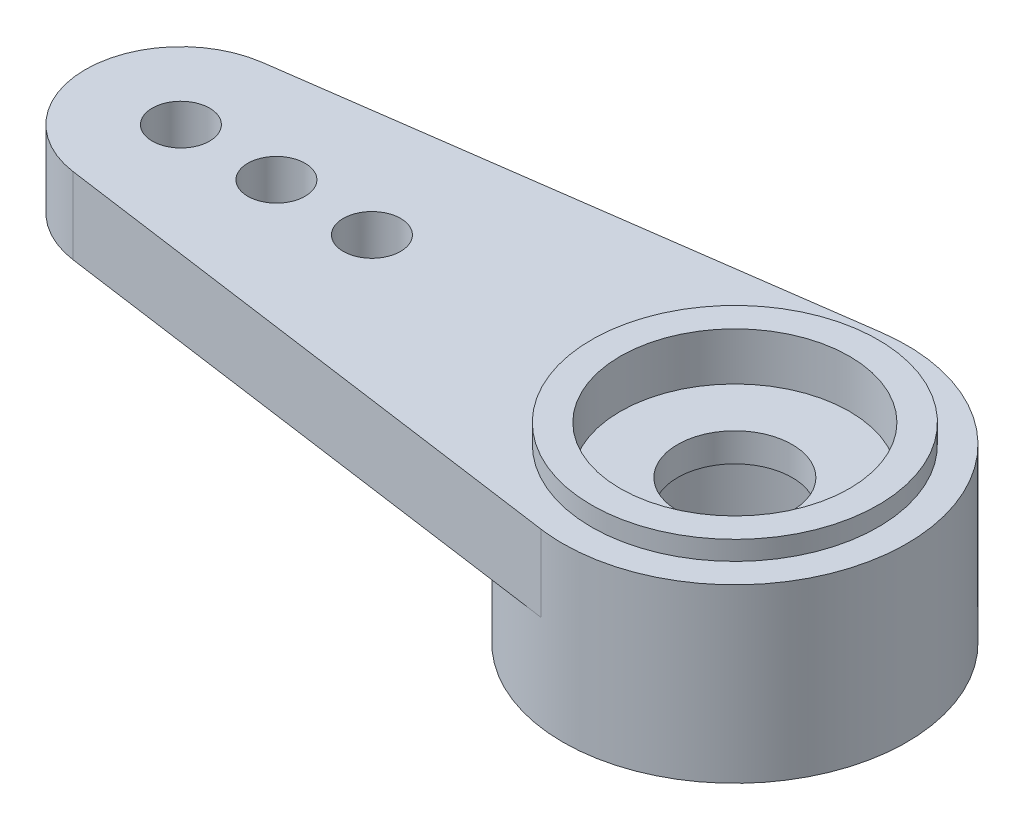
ISO-10303-21;
HEADER;
FILE_DESCRIPTION(('STEP AP214'),'2;1');
FILE_NAME('part.step','',(''),(''),'','','');
FILE_SCHEMA(('AUTOMOTIVE_DESIGN { 1 0 10303 214 1 1 1 1 }'));
ENDSEC;
DATA;
#1=APPLICATION_CONTEXT('core data for automotive mechanical design processes');
#2=APPLICATION_PROTOCOL_DEFINITION('international standard','automotive_design',2000,#1);
#3=PRODUCT_CONTEXT('',#1,'mechanical');
#4=PRODUCT('Part','Part','',(#3));
#5=PRODUCT_RELATED_PRODUCT_CATEGORY('part','',(#4));
#6=PRODUCT_DEFINITION_FORMATION('','',#4);
#7=PRODUCT_DEFINITION_CONTEXT('part definition',#1,'design');
#8=PRODUCT_DEFINITION('design','',#6,#7);
#9=PRODUCT_DEFINITION_SHAPE('','',#8);
#10=(LENGTH_UNIT() NAMED_UNIT(*) SI_UNIT(.MILLI.,.METRE.));
#11=(NAMED_UNIT(*) PLANE_ANGLE_UNIT() SI_UNIT($,.RADIAN.));
#12=(NAMED_UNIT(*) SI_UNIT($,.STERADIAN.) SOLID_ANGLE_UNIT());
#13=UNCERTAINTY_MEASURE_WITH_UNIT(LENGTH_MEASURE(1.E-05),#10,'distance_accuracy_value','');
#14=(GEOMETRIC_REPRESENTATION_CONTEXT(3) GLOBAL_UNCERTAINTY_ASSIGNED_CONTEXT((#13)) GLOBAL_UNIT_ASSIGNED_CONTEXT((#10,
#11,#12)) REPRESENTATION_CONTEXT('',''));
#15=CARTESIAN_POINT('',(0.,0.,0.));
#16=DIRECTION('',(0.,0.,1.));
#17=DIRECTION('',(1.,0.,0.));
#18=AXIS2_PLACEMENT_3D('',#15,#16,#17);
#19=CARTESIAN_POINT('',(17.,4.5,0.));
#20=DIRECTION('',(0.,-1.,0.));
#21=DIRECTION('',(0.,0.,-1.));
#22=AXIS2_PLACEMENT_3D('',#19,#20,#21);
#23=PLANE('',#22);
#24=CARTESIAN_POINT('',(-14.5,4.5,0.));
#25=DIRECTION('',(0.,1.,0.));
#26=DIRECTION('',(0.,0.,1.));
#27=AXIS2_PLACEMENT_3D('',#24,#25,#26);
#28=CIRCLE('',#27,0.750000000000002);
#29=CARTESIAN_POINT('',(-14.5,4.5,0.750000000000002));
#30=VERTEX_POINT('',#29);
#31=EDGE_CURVE('E103',#30,#30,#28,.T.);
#32=ORIENTED_EDGE('',*,*,#31,.F.);
#33=EDGE_LOOP('',(#32));
#34=FACE_BOUND('',#33,.T.);
#35=CARTESIAN_POINT('',(-12.,4.5,0.));
#36=DIRECTION('',(0.,1.,0.));
#37=DIRECTION('',(0.,0.,1.));
#38=AXIS2_PLACEMENT_3D('',#35,#36,#37);
#39=CIRCLE('',#38,0.75);
#40=CARTESIAN_POINT('',(-12.,4.5,0.75));
#41=VERTEX_POINT('',#40);
#42=EDGE_CURVE('E107',#41,#41,#39,.T.);
#43=ORIENTED_EDGE('',*,*,#42,.F.);
#44=EDGE_LOOP('',(#43));
#45=FACE_BOUND('',#44,.T.);
#46=CARTESIAN_POINT('',(-9.5,4.5,0.));
#47=DIRECTION('',(0.,1.,0.));
#48=DIRECTION('',(0.,0.,-1.));
#49=AXIS2_PLACEMENT_3D('',#46,#47,#48);
#50=CIRCLE('',#49,0.75);
#51=CARTESIAN_POINT('',(-9.5,4.5,-0.75));
#52=VERTEX_POINT('',#51);
#53=EDGE_CURVE('E111',#52,#52,#50,.T.);
#54=ORIENTED_EDGE('',*,*,#53,.F.);
#55=EDGE_LOOP('',(#54));
#56=FACE_BOUND('',#55,.T.);
#57=CARTESIAN_POINT('',(0.,4.5,0.));
#58=DIRECTION('',(0.,1.,0.));
#59=DIRECTION('',(0.,0.,1.));
#60=AXIS2_PLACEMENT_3D('',#57,#58,#59);
#61=CIRCLE('',#60,3.75);
#62=CARTESIAN_POINT('',(0.,4.5,3.75));
#63=VERTEX_POINT('',#62);
#64=EDGE_CURVE('E115',#63,#63,#61,.T.);
#65=ORIENTED_EDGE('',*,*,#64,.F.);
#66=EDGE_LOOP('',(#65));
#67=FACE_BOUND('',#66,.T.);
#68=DIRECTION('',(0.990441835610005,0.,0.137931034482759));
#69=VECTOR('',#68,1.);
#70=CARTESIAN_POINT('',(-14.8448275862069,4.5,2.47610458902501));
#71=LINE('',#70,#69);
#72=CARTESIAN_POINT('',(-14.8448275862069,4.5,2.47610458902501));
#73=VERTEX_POINT('',#72);
#74=CARTESIAN_POINT('',(-0.62068965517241,4.5,4.45698826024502));
#75=VERTEX_POINT('',#74);
#76=EDGE_CURVE('E90',#73,#75,#71,.T.);
#77=ORIENTED_EDGE('',*,*,#76,.T.);
#78=CARTESIAN_POINT('',(0.,4.5,0.));
#79=DIRECTION('',(0.,1.,0.));
#80=DIRECTION('',(0.,0.,1.));
#81=AXIS2_PLACEMENT_3D('',#78,#79,#80);
#82=CIRCLE('',#81,4.5);
#83=CARTESIAN_POINT('',(-0.620689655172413,4.5,-4.45698826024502));
#84=VERTEX_POINT('',#83);
#85=EDGE_CURVE('E46',#75,#84,#82,.T.);
#86=ORIENTED_EDGE('',*,*,#85,.T.);
#87=DIRECTION('',(-0.990441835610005,0.,0.137931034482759));
#88=VECTOR('',#87,1.);
#89=CARTESIAN_POINT('',(-14.8448275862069,4.5,-2.47610458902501));
#90=LINE('',#89,#88);
#91=CARTESIAN_POINT('',(-14.8448275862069,4.5,-2.47610458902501));
#92=VERTEX_POINT('',#91);
#93=EDGE_CURVE('E83',#84,#92,#90,.T.);
#94=ORIENTED_EDGE('',*,*,#93,.T.);
#95=CARTESIAN_POINT('',(-14.5,4.5,0.));
#96=DIRECTION('',(0.,1.,0.));
#97=DIRECTION('',(0.,0.,-1.));
#98=AXIS2_PLACEMENT_3D('',#95,#96,#97);
#99=CIRCLE('',#98,2.5);
#100=EDGE_CURVE('E92',#92,#73,#99,.T.);
#101=ORIENTED_EDGE('',*,*,#100,.T.);
#102=EDGE_LOOP('',(#77,#86,#94,#101));
#103=FACE_BOUND('',#102,.T.);
#104=ADVANCED_FACE('F32',(#34,#45,#56,#67,#103),#23,.F.);
#105=CARTESIAN_POINT('',(4.5,2.5,0.));
#106=DIRECTION('',(0.,1.,0.));
#107=DIRECTION('',(0.,0.,1.));
#108=AXIS2_PLACEMENT_3D('',#105,#106,#107);
#109=PLANE('',#108);
#110=CARTESIAN_POINT('',(-9.5,2.5,0.));
#111=DIRECTION('',(0.,1.,0.));
#112=DIRECTION('',(0.,0.,1.));
#113=AXIS2_PLACEMENT_3D('',#110,#111,#112);
#114=CIRCLE('',#113,0.75);
#115=CARTESIAN_POINT('',(-9.5,2.5,0.75));
#116=VERTEX_POINT('',#115);
#117=EDGE_CURVE('E114',#116,#116,#114,.T.);
#118=ORIENTED_EDGE('',*,*,#117,.T.);
#119=EDGE_LOOP('',(#118));
#120=FACE_BOUND('',#119,.T.);
#121=CARTESIAN_POINT('',(-12.,2.5,0.));
#122=DIRECTION('',(0.,1.,0.));
#123=DIRECTION('',(0.,0.,1.));
#124=AXIS2_PLACEMENT_3D('',#121,#122,#123);
#125=CIRCLE('',#124,0.75);
#126=CARTESIAN_POINT('',(-12.,2.5,0.75));
#127=VERTEX_POINT('',#126);
#128=EDGE_CURVE('E110',#127,#127,#125,.T.);
#129=ORIENTED_EDGE('',*,*,#128,.T.);
#130=EDGE_LOOP('',(#129));
#131=FACE_BOUND('',#130,.T.);
#132=CARTESIAN_POINT('',(-14.5,2.5,0.));
#133=DIRECTION('',(0.,1.,0.));
#134=DIRECTION('',(0.,0.,1.));
#135=AXIS2_PLACEMENT_3D('',#132,#133,#134);
#136=CIRCLE('',#135,0.750000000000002);
#137=CARTESIAN_POINT('',(-14.5,2.5,0.750000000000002));
#138=VERTEX_POINT('',#137);
#139=EDGE_CURVE('E106',#138,#138,#136,.T.);
#140=ORIENTED_EDGE('',*,*,#139,.T.);
#141=EDGE_LOOP('',(#140));
#142=FACE_BOUND('',#141,.T.);
#143=DIRECTION('',(-0.990441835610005,0.,0.137931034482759));
#144=VECTOR('',#143,1.);
#145=CARTESIAN_POINT('',(3.79369797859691,2.5,-5.07174526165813));
#146=LINE('',#145,#144);
#147=CARTESIAN_POINT('',(-0.620689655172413,2.5,-4.45698826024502));
#148=VERTEX_POINT('',#147);
#149=CARTESIAN_POINT('',(-14.8448275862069,2.5,-2.47610458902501));
#150=VERTEX_POINT('',#149);
#151=EDGE_CURVE('E101',#148,#150,#146,.T.);
#152=ORIENTED_EDGE('',*,*,#151,.F.);
#153=CARTESIAN_POINT('',(0.,2.5,0.));
#154=DIRECTION('',(0.,1.,0.));
#155=DIRECTION('',(0.,0.,1.));
#156=AXIS2_PLACEMENT_3D('',#153,#154,#155);
#157=CIRCLE('',#156,4.5);
#158=CARTESIAN_POINT('',(-0.620689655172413,2.5,4.45698826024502));
#159=VERTEX_POINT('',#158);
#160=EDGE_CURVE('E39',#148,#159,#157,.T.);
#161=ORIENTED_EDGE('',*,*,#160,.T.);
#162=DIRECTION('',(0.990441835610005,0.,0.137931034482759));
#163=VECTOR('',#162,1.);
#164=CARTESIAN_POINT('',(3.79369797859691,2.5,5.07174526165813));
#165=LINE('',#164,#163);
#166=CARTESIAN_POINT('',(-14.8448275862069,2.5,2.47610458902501));
#167=VERTEX_POINT('',#166);
#168=EDGE_CURVE('E96',#167,#159,#165,.T.);
#169=ORIENTED_EDGE('',*,*,#168,.F.);
#170=CARTESIAN_POINT('',(-14.5,2.5,0.));
#171=DIRECTION('',(0.,1.,0.));
#172=DIRECTION('',(0.,0.,1.));
#173=AXIS2_PLACEMENT_3D('',#170,#171,#172);
#174=CIRCLE('',#173,2.5);
#175=EDGE_CURVE('E12',#150,#167,#174,.T.);
#176=ORIENTED_EDGE('',*,*,#175,.F.);
#177=EDGE_LOOP('',(#152,#161,#169,#176));
#178=FACE_BOUND('',#177,.T.);
#179=ADVANCED_FACE('F149',(#120,#131,#142,#178),#109,.F.);
#180=CARTESIAN_POINT('',(0.,9.56085964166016,0.));
#181=DIRECTION('',(0.,1.,0.));
#182=DIRECTION('',(0.,0.,1.));
#183=AXIS2_PLACEMENT_3D('',#180,#181,#182);
#184=CYLINDRICAL_SURFACE('',#183,4.5);
#185=ORIENTED_EDGE('',*,*,#85,.F.);
#186=DIRECTION('',(0.,1.,0.));
#187=VECTOR('',#186,1.);
#188=CARTESIAN_POINT('',(-0.620689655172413,0.,4.45698826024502));
#189=LINE('',#188,#187);
#190=EDGE_CURVE('E80',#159,#75,#189,.T.);
#191=ORIENTED_EDGE('',*,*,#190,.F.);
#192=ORIENTED_EDGE('',*,*,#160,.F.);
#193=DIRECTION('',(0.,1.,0.));
#194=VECTOR('',#193,1.);
#195=CARTESIAN_POINT('',(-0.620689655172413,0.,-4.45698826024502));
#196=LINE('',#195,#194);
#197=EDGE_CURVE('E71',#148,#84,#196,.T.);
#198=ORIENTED_EDGE('',*,*,#197,.T.);
#199=EDGE_LOOP('',(#185,#191,#192,#198));
#200=FACE_BOUND('',#199,.T.);
#201=CARTESIAN_POINT('',(0.,0.,0.));
#202=DIRECTION('',(0.,1.,0.));
#203=DIRECTION('',(0.,0.,1.));
#204=AXIS2_PLACEMENT_3D('',#201,#202,#203);
#205=CIRCLE('',#204,4.5);
#206=CARTESIAN_POINT('',(0.,0.,4.5));
#207=VERTEX_POINT('',#206);
#208=EDGE_CURVE('E139',#207,#207,#205,.T.);
#209=ORIENTED_EDGE('',*,*,#208,.T.);
#210=EDGE_LOOP('',(#209));
#211=FACE_BOUND('',#210,.T.);
#212=ADVANCED_FACE('F73',(#200,#211),#184,.T.);
#213=CARTESIAN_POINT('',(3.00000000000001,0.,0.));
#214=DIRECTION('',(0.,1.,0.));
#215=DIRECTION('',(0.,0.,1.));
#216=AXIS2_PLACEMENT_3D('',#213,#214,#215);
#217=PLANE('',#216);
#218=ORIENTED_EDGE('',*,*,#208,.F.);
#219=EDGE_LOOP('',(#218));
#220=FACE_BOUND('',#219,.T.);
#221=CARTESIAN_POINT('',(0.,0.,0.));
#222=DIRECTION('',(0.,1.,0.));
#223=DIRECTION('',(0.,0.,1.));
#224=AXIS2_PLACEMENT_3D('',#221,#222,#223);
#225=CIRCLE('',#224,3.00000000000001);
#226=CARTESIAN_POINT('',(0.,0.,3.00000000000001));
#227=VERTEX_POINT('',#226);
#228=EDGE_CURVE('E136',#227,#227,#225,.T.);
#229=ORIENTED_EDGE('',*,*,#228,.T.);
#230=EDGE_LOOP('',(#229));
#231=FACE_BOUND('',#230,.T.);
#232=ADVANCED_FACE('F215',(#220,#231),#217,.F.);
#233=CARTESIAN_POINT('',(0.,9.56085964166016,0.));
#234=DIRECTION('',(0.,1.,0.));
#235=DIRECTION('',(0.,0.,1.));
#236=AXIS2_PLACEMENT_3D('',#233,#234,#235);
#237=CYLINDRICAL_SURFACE('',#236,3.00000000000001);
#238=ORIENTED_EDGE('',*,*,#228,.F.);
#239=EDGE_LOOP('',(#238));
#240=FACE_BOUND('',#239,.T.);
#241=CARTESIAN_POINT('',(0.,3.,0.));
#242=DIRECTION('',(0.,1.,0.));
#243=DIRECTION('',(0.,0.,1.));
#244=AXIS2_PLACEMENT_3D('',#241,#242,#243);
#245=CIRCLE('',#244,3.00000000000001);
#246=CARTESIAN_POINT('',(0.,3.,3.00000000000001));
#247=VERTEX_POINT('',#246);
#248=EDGE_CURVE('E133',#247,#247,#245,.T.);
#249=ORIENTED_EDGE('',*,*,#248,.T.);
#250=EDGE_LOOP('',(#249));
#251=FACE_BOUND('',#250,.T.);
#252=ADVANCED_FACE('F211',(#240,#251),#237,.F.);
#253=CARTESIAN_POINT('',(1.50000000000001,3.,0.));
#254=DIRECTION('',(0.,1.,0.));
#255=DIRECTION('',(0.,0.,1.));
#256=AXIS2_PLACEMENT_3D('',#253,#254,#255);
#257=PLANE('',#256);
#258=ORIENTED_EDGE('',*,*,#248,.F.);
#259=EDGE_LOOP('',(#258));
#260=FACE_BOUND('',#259,.T.);
#261=CARTESIAN_POINT('',(0.,3.,0.));
#262=DIRECTION('',(0.,1.,0.));
#263=DIRECTION('',(0.,0.,1.));
#264=AXIS2_PLACEMENT_3D('',#261,#262,#263);
#265=CIRCLE('',#264,1.50000000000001);
#266=CARTESIAN_POINT('',(0.,3.,1.50000000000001));
#267=VERTEX_POINT('',#266);
#268=EDGE_CURVE('E130',#267,#267,#265,.T.);
#269=ORIENTED_EDGE('',*,*,#268,.T.);
#270=EDGE_LOOP('',(#269));
#271=FACE_BOUND('',#270,.T.);
#272=ADVANCED_FACE('F207',(#260,#271),#257,.F.);
#273=CARTESIAN_POINT('',(0.,9.56085964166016,0.));
#274=DIRECTION('',(0.,1.,0.));
#275=DIRECTION('',(0.,0.,1.));
#276=AXIS2_PLACEMENT_3D('',#273,#274,#275);
#277=CYLINDRICAL_SURFACE('',#276,1.50000000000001);
#278=ORIENTED_EDGE('',*,*,#268,.F.);
#279=EDGE_LOOP('',(#278));
#280=FACE_BOUND('',#279,.T.);
#281=CARTESIAN_POINT('',(0.,3.75,0.));
#282=DIRECTION('',(0.,1.,0.));
#283=DIRECTION('',(0.,0.,1.));
#284=AXIS2_PLACEMENT_3D('',#281,#282,#283);
#285=CIRCLE('',#284,1.50000000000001);
#286=CARTESIAN_POINT('',(0.,3.75,1.50000000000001));
#287=VERTEX_POINT('',#286);
#288=EDGE_CURVE('E127',#287,#287,#285,.T.);
#289=ORIENTED_EDGE('',*,*,#288,.T.);
#290=EDGE_LOOP('',(#289));
#291=FACE_BOUND('',#290,.T.);
#292=ADVANCED_FACE('F203',(#280,#291),#277,.F.);
#293=CARTESIAN_POINT('',(3.00000000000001,3.75,0.));
#294=DIRECTION('',(0.,-1.,0.));
#295=DIRECTION('',(0.,0.,-1.));
#296=AXIS2_PLACEMENT_3D('',#293,#294,#295);
#297=PLANE('',#296);
#298=ORIENTED_EDGE('',*,*,#288,.F.);
#299=EDGE_LOOP('',(#298));
#300=FACE_BOUND('',#299,.T.);
#301=CARTESIAN_POINT('',(0.,3.75,0.));
#302=DIRECTION('',(0.,1.,0.));
#303=DIRECTION('',(0.,0.,1.));
#304=AXIS2_PLACEMENT_3D('',#301,#302,#303);
#305=CIRCLE('',#304,3.00000000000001);
#306=CARTESIAN_POINT('',(0.,3.75,3.00000000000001));
#307=VERTEX_POINT('',#306);
#308=EDGE_CURVE('E124',#307,#307,#305,.T.);
#309=ORIENTED_EDGE('',*,*,#308,.T.);
#310=EDGE_LOOP('',(#309));
#311=FACE_BOUND('',#310,.T.);
#312=ADVANCED_FACE('F199',(#300,#311),#297,.F.);
#313=CARTESIAN_POINT('',(0.,9.56085964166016,0.));
#314=DIRECTION('',(0.,1.,0.));
#315=DIRECTION('',(0.,0.,1.));
#316=AXIS2_PLACEMENT_3D('',#313,#314,#315);
#317=CYLINDRICAL_SURFACE('',#316,3.00000000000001);
#318=ORIENTED_EDGE('',*,*,#308,.F.);
#319=EDGE_LOOP('',(#318));
#320=FACE_BOUND('',#319,.T.);
#321=CARTESIAN_POINT('',(0.,5.,0.));
#322=DIRECTION('',(0.,1.,0.));
#323=DIRECTION('',(0.,0.,1.));
#324=AXIS2_PLACEMENT_3D('',#321,#322,#323);
#325=CIRCLE('',#324,3.00000000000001);
#326=CARTESIAN_POINT('',(0.,5.,3.00000000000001));
#327=VERTEX_POINT('',#326);
#328=EDGE_CURVE('E121',#327,#327,#325,.T.);
#329=ORIENTED_EDGE('',*,*,#328,.T.);
#330=EDGE_LOOP('',(#329));
#331=FACE_BOUND('',#330,.T.);
#332=ADVANCED_FACE('F192',(#320,#331),#317,.F.);
#333=CARTESIAN_POINT('',(3.75,5.,0.));
#334=DIRECTION('',(0.,-1.,0.));
#335=DIRECTION('',(0.,0.,-1.));
#336=AXIS2_PLACEMENT_3D('',#333,#334,#335);
#337=PLANE('',#336);
#338=ORIENTED_EDGE('',*,*,#328,.F.);
#339=EDGE_LOOP('',(#338));
#340=FACE_BOUND('',#339,.T.);
#341=CARTESIAN_POINT('',(0.,5.,0.));
#342=DIRECTION('',(0.,1.,0.));
#343=DIRECTION('',(0.,0.,1.));
#344=AXIS2_PLACEMENT_3D('',#341,#342,#343);
#345=CIRCLE('',#344,3.75);
#346=CARTESIAN_POINT('',(0.,5.,3.75));
#347=VERTEX_POINT('',#346);
#348=EDGE_CURVE('E118',#347,#347,#345,.T.);
#349=ORIENTED_EDGE('',*,*,#348,.T.);
#350=EDGE_LOOP('',(#349));
#351=FACE_BOUND('',#350,.T.);
#352=ADVANCED_FACE('F183',(#340,#351),#337,.F.);
#353=CARTESIAN_POINT('',(0.,9.56085964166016,0.));
#354=DIRECTION('',(0.,1.,0.));
#355=DIRECTION('',(0.,0.,1.));
#356=AXIS2_PLACEMENT_3D('',#353,#354,#355);
#357=CYLINDRICAL_SURFACE('',#356,3.75);
#358=ORIENTED_EDGE('',*,*,#348,.F.);
#359=EDGE_LOOP('',(#358));
#360=FACE_BOUND('',#359,.T.);
#361=ORIENTED_EDGE('',*,*,#64,.T.);
#362=EDGE_LOOP('',(#361));
#363=FACE_BOUND('',#362,.T.);
#364=ADVANCED_FACE('F181',(#360,#363),#357,.T.);
#365=CARTESIAN_POINT('',(-9.5,0.,0.));
#366=DIRECTION('',(0.,1.,0.));
#367=DIRECTION('',(0.,0.,1.));
#368=AXIS2_PLACEMENT_3D('',#365,#366,#367);
#369=CYLINDRICAL_SURFACE('',#368,0.75);
#370=ORIENTED_EDGE('',*,*,#53,.T.);
#371=EDGE_LOOP('',(#370));
#372=FACE_BOUND('',#371,.T.);
#373=ORIENTED_EDGE('',*,*,#117,.F.);
#374=EDGE_LOOP('',(#373));
#375=FACE_BOUND('',#374,.T.);
#376=ADVANCED_FACE('F164',(#372,#375),#369,.F.);
#377=CARTESIAN_POINT('',(-12.,0.,0.));
#378=DIRECTION('',(0.,1.,0.));
#379=DIRECTION('',(0.,0.,1.));
#380=AXIS2_PLACEMENT_3D('',#377,#378,#379);
#381=CYLINDRICAL_SURFACE('',#380,0.75);
#382=ORIENTED_EDGE('',*,*,#42,.T.);
#383=EDGE_LOOP('',(#382));
#384=FACE_BOUND('',#383,.T.);
#385=ORIENTED_EDGE('',*,*,#128,.F.);
#386=EDGE_LOOP('',(#385));
#387=FACE_BOUND('',#386,.T.);
#388=ADVANCED_FACE('F155',(#384,#387),#381,.F.);
#389=CARTESIAN_POINT('',(-14.5,0.,0.));
#390=DIRECTION('',(0.,1.,0.));
#391=DIRECTION('',(0.,0.,1.));
#392=AXIS2_PLACEMENT_3D('',#389,#390,#391);
#393=CYLINDRICAL_SURFACE('',#392,0.750000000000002);
#394=ORIENTED_EDGE('',*,*,#31,.T.);
#395=EDGE_LOOP('',(#394));
#396=FACE_BOUND('',#395,.T.);
#397=ORIENTED_EDGE('',*,*,#139,.F.);
#398=EDGE_LOOP('',(#397));
#399=FACE_BOUND('',#398,.T.);
#400=ADVANCED_FACE('F152',(#396,#399),#393,.F.);
#401=CARTESIAN_POINT('',(-14.5,0.,0.));
#402=DIRECTION('',(0.,1.,0.));
#403=DIRECTION('',(0.,0.,1.));
#404=AXIS2_PLACEMENT_3D('',#401,#402,#403);
#405=CYLINDRICAL_SURFACE('',#404,2.5);
#406=DIRECTION('',(0.,1.,0.));
#407=VECTOR('',#406,1.);
#408=CARTESIAN_POINT('',(-14.8448275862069,0.,-2.47610458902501));
#409=LINE('',#408,#407);
#410=EDGE_CURVE('E79',#150,#92,#409,.T.);
#411=ORIENTED_EDGE('',*,*,#410,.F.);
#412=ORIENTED_EDGE('',*,*,#175,.T.);
#413=DIRECTION('',(0.,1.,0.));
#414=VECTOR('',#413,1.);
#415=CARTESIAN_POINT('',(-14.8448275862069,0.,2.47610458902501));
#416=LINE('',#415,#414);
#417=EDGE_CURVE('E54',#167,#73,#416,.T.);
#418=ORIENTED_EDGE('',*,*,#417,.T.);
#419=ORIENTED_EDGE('',*,*,#100,.F.);
#420=EDGE_LOOP('',(#411,#412,#418,#419));
#421=FACE_BOUND('',#420,.T.);
#422=ADVANCED_FACE('F154',(#421),#405,.T.);
#423=CARTESIAN_POINT('',(-14.8448275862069,0.,-2.47610458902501));
#424=DIRECTION('',(-0.137931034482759,0.,-0.990441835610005));
#425=DIRECTION('',(-0.990441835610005,0.,0.137931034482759));
#426=AXIS2_PLACEMENT_3D('',#423,#424,#425);
#427=PLANE('',#426);
#428=ORIENTED_EDGE('',*,*,#151,.T.);
#429=ORIENTED_EDGE('',*,*,#410,.T.);
#430=ORIENTED_EDGE('',*,*,#93,.F.);
#431=ORIENTED_EDGE('',*,*,#197,.F.);
#432=EDGE_LOOP('',(#428,#429,#430,#431));
#433=FACE_BOUND('',#432,.T.);
#434=ADVANCED_FACE('F84',(#433),#427,.T.);
#435=CARTESIAN_POINT('',(-14.8448275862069,0.,2.47610458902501));
#436=DIRECTION('',(-0.137931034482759,0.,0.990441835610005));
#437=DIRECTION('',(0.990441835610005,0.,0.137931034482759));
#438=AXIS2_PLACEMENT_3D('',#435,#436,#437);
#439=PLANE('',#438);
#440=ORIENTED_EDGE('',*,*,#168,.T.);
#441=ORIENTED_EDGE('',*,*,#190,.T.);
#442=ORIENTED_EDGE('',*,*,#76,.F.);
#443=ORIENTED_EDGE('',*,*,#417,.F.);
#444=EDGE_LOOP('',(#440,#441,#442,#443));
#445=FACE_BOUND('',#444,.T.);
#446=ADVANCED_FACE('F294',(#445),#439,.T.);
#447=CLOSED_SHELL('',(#104,#179,#212,#232,#252,#272,#292,#312,#332,#352,#364,#376,#388,#400,
#422,#434,#446));
#448=MANIFOLD_SOLID_BREP('B2',#447);
#449=ADVANCED_BREP_SHAPE_REPRESENTATION('',(#18,#448),#14);
#450=SHAPE_DEFINITION_REPRESENTATION(#9,#449);
ENDSEC;
END-ISO-10303-21;
